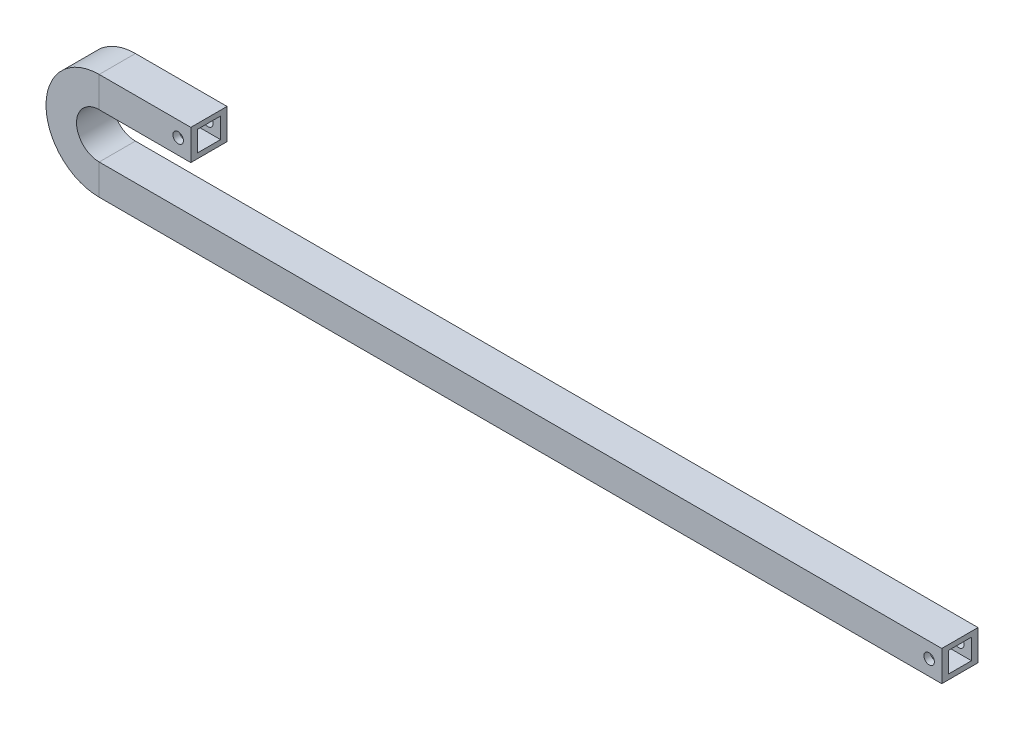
from build123d import *

# Parameters (mm, degrees)
SKIZZE1_W                       = 17.2
SKIZZE1_H                       = 14.5
SKIZZE1_W_2                     = 11
SKIZZE1_H_2                     = 9.7
SKIZZE4_R                       = 2.5
SCHNITT_LINEAR_AUSTRAGEN1_DEPTH = 428.789627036


with BuildPart() as part:
    # Austragung1: sweep along a path in Skizze3
    with BuildLine(Plane.XY) as austragung1_path:
        Line((0, 0), (-400, 0))
        ThreePointArc((-400, 0), (-418, 18), (-400, 36))
        Line((-400, 36), (-356.5, 36))
    # Skizze1 → Austragung1 (sweep)
    with BuildSketch(Plane(origin=(0, 0, 0), x_dir=(0, 0, -1), z_dir=(1, 0, 0))):
        Rectangle(SKIZZE1_W, SKIZZE1_H)
        Rectangle(SKIZZE1_W_2, SKIZZE1_H_2, mode=Mode.SUBTRACT)
    sweep(path=austragung1_path.line)

    # Skizze4 → Schnitt-Linear austragen1 (cut, through all)
    with BuildSketch(Plane.XY.offset(8.6)):
        with Locations((-362.5, 36)):
            Circle(SKIZZE4_R)
        with Locations((-6, 0)):
            Circle(SKIZZE4_R)
    extrude(amount=-SCHNITT_LINEAR_AUSTRAGEN1_DEPTH, mode=Mode.SUBTRACT)


solid = part.part
